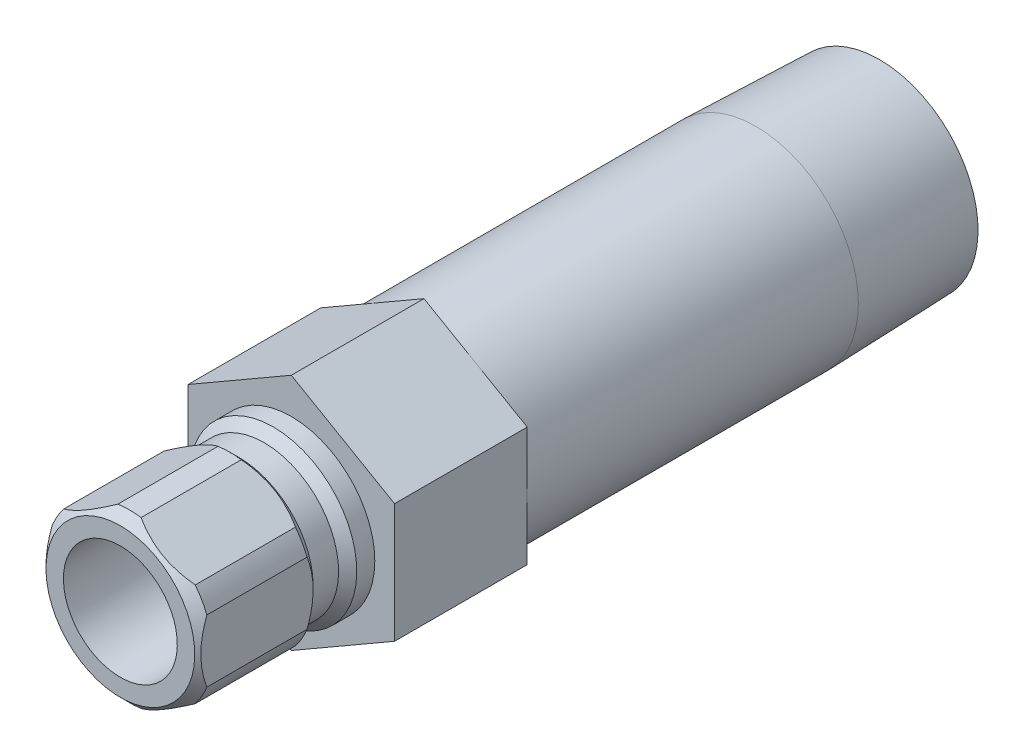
from build123d import *

# Parameters (mm, degrees)
SKETCH2_R           = 4.7625
BOSS_EXTRUDE1_DEPTH = 11.0998
CUT_EXTRUDE1_START  = 4.3942
SKETCH3_OUTSIDE_W   = 33.024
SKETCH3_OUTSIDE_H   = 35.696
CUT_EXTRUDE1_DEPTH  = 47.543423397


with BuildPart() as part:
    # Sketch1 → Revolve1 (revolve)
    with BuildSketch(Plane(origin=(0, 0, 0), x_dir=(0, 0, -1), z_dir=(1, 0, 0))):
        Polygon((-14.3002, 4.7625), (-14.3002, 6.223), (-13.5382, 6.985), (-5.1562, 6.985), (-4.3942, 6.223), (-2.27076, 6.223), (-1.50876, 6.985), (3.175, 6.985), (3.175, 8.5725), (38.862, 8.5725), (49.1998, 8.249445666), (49.1998, 6.2611), (11.0998, 6.2611), (11.0998, 4.7625), align=None)
    revolve(axis=Axis((0, 0, 0), (0, 0, 1)))

    # Sketch2 → Boss-Extrude1 (add)
    with BuildSketch(Plane.XY):
        Polygon((-8.636, 4.985996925), (-8.636, -4.985996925), (0, -9.971993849), (8.636, -4.985996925), (8.636, 4.985996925), (0, 9.971993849), align=None)
        with Locations(Location((0, 0, 0), (0, 0, 90))):
            Circle(SKETCH2_R, mode=Mode.SUBTRACT)
    extrude(amount=-BOSS_EXTRUDE1_DEPTH)

    # Sketch3 outside → Cut-Extrude1 (cut, through all)
    with BuildSketch(Plane.XY.offset(CUT_EXTRUDE1_START)):
        Rectangle(SKETCH3_OUTSIDE_W, SKETCH3_OUTSIDE_H)
        Polygon((6.477, -3.739497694), (6.477, 3.739497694), (0, 7.478995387), (-6.477, 3.739497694), (-6.477, -3.739497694), (0, -7.478995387), align=None, mode=Mode.SUBTRACT)
    extrude(amount=CUT_EXTRUDE1_DEPTH, mode=Mode.SUBTRACT)


solid = part.part
